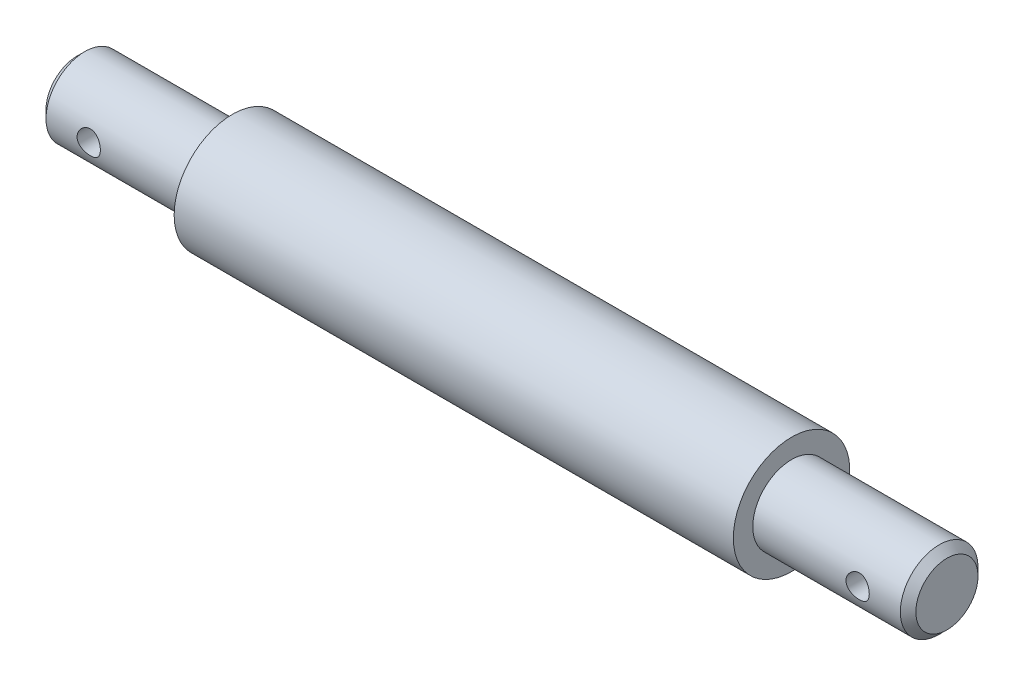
ISO-10303-21;
HEADER;
FILE_DESCRIPTION(('STEP AP214'),'2;1');
FILE_NAME('part.step','',(''),(''),'','','');
FILE_SCHEMA(('AUTOMOTIVE_DESIGN { 1 0 10303 214 1 1 1 1 }'));
ENDSEC;
DATA;
#1=APPLICATION_CONTEXT('core data for automotive mechanical design processes');
#2=APPLICATION_PROTOCOL_DEFINITION('international standard','automotive_design',2000,#1);
#3=PRODUCT_CONTEXT('',#1,'mechanical');
#4=PRODUCT('Part','Part','',(#3));
#5=PRODUCT_RELATED_PRODUCT_CATEGORY('part','',(#4));
#6=PRODUCT_DEFINITION_FORMATION('','',#4);
#7=PRODUCT_DEFINITION_CONTEXT('part definition',#1,'design');
#8=PRODUCT_DEFINITION('design','',#6,#7);
#9=PRODUCT_DEFINITION_SHAPE('','',#8);
#10=(LENGTH_UNIT() NAMED_UNIT(*) SI_UNIT(.MILLI.,.METRE.));
#11=(NAMED_UNIT(*) PLANE_ANGLE_UNIT() SI_UNIT($,.RADIAN.));
#12=(NAMED_UNIT(*) SI_UNIT($,.STERADIAN.) SOLID_ANGLE_UNIT());
#13=UNCERTAINTY_MEASURE_WITH_UNIT(LENGTH_MEASURE(1.E-05),#10,'distance_accuracy_value','');
#14=(GEOMETRIC_REPRESENTATION_CONTEXT(3) GLOBAL_UNCERTAINTY_ASSIGNED_CONTEXT((#13)) GLOBAL_UNIT_ASSIGNED_CONTEXT((#10,
#11,#12)) REPRESENTATION_CONTEXT('',''));
#15=CARTESIAN_POINT('',(0.,0.,0.));
#16=DIRECTION('',(0.,0.,1.));
#17=DIRECTION('',(1.,0.,0.));
#18=AXIS2_PLACEMENT_3D('',#15,#16,#17);
#19=CARTESIAN_POINT('',(-51.7168949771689,0.,0.));
#20=DIRECTION('',(1.,0.,0.));
#21=DIRECTION('',(0.,0.,-1.));
#22=AXIS2_PLACEMENT_3D('',#19,#20,#21);
#23=PLANE('',#22);
#24=CARTESIAN_POINT('',(-51.7168949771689,0.,0.));
#25=DIRECTION('',(-1.,0.,0.));
#26=DIRECTION('',(0.,0.,1.));
#27=AXIS2_PLACEMENT_3D('',#24,#25,#26);
#28=CIRCLE('',#27,4.);
#29=CARTESIAN_POINT('',(-51.7168949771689,0.,4.));
#30=VERTEX_POINT('',#29);
#31=EDGE_CURVE('E10',#30,#30,#28,.T.);
#32=ORIENTED_EDGE('',*,*,#31,.T.);
#33=EDGE_LOOP('',(#32));
#34=FACE_BOUND('',#33,.T.);
#35=ADVANCED_FACE('F34',(#34),#23,.F.);
#36=CARTESIAN_POINT('',(-50.7168949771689,0.,0.));
#37=DIRECTION('',(1.,0.,0.));
#38=DIRECTION('',(0.,0.,-1.));
#39=AXIS2_PLACEMENT_3D('',#36,#37,#38);
#40=CONICAL_SURFACE('',#39,5.,0.785398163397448);
#41=ORIENTED_EDGE('',*,*,#31,.F.);
#42=EDGE_LOOP('',(#41));
#43=FACE_BOUND('',#42,.T.);
#44=CARTESIAN_POINT('',(-50.7168949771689,0.,0.));
#45=DIRECTION('',(-1.,0.,0.));
#46=DIRECTION('',(0.,0.,1.));
#47=AXIS2_PLACEMENT_3D('',#44,#45,#46);
#48=CIRCLE('',#47,5.);
#49=CARTESIAN_POINT('',(-50.7168949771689,0.,5.));
#50=VERTEX_POINT('',#49);
#51=EDGE_CURVE('E45',#50,#50,#48,.T.);
#52=ORIENTED_EDGE('',*,*,#51,.T.);
#53=EDGE_LOOP('',(#52));
#54=FACE_BOUND('',#53,.T.);
#55=ADVANCED_FACE('F104',(#43,#54),#40,.T.);
#56=CARTESIAN_POINT('',(-59.9259259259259,0.,0.));
#57=DIRECTION('',(-1.,0.,0.));
#58=DIRECTION('',(0.,0.,1.));
#59=AXIS2_PLACEMENT_3D('',#56,#57,#58);
#60=CYLINDRICAL_SURFACE('',#59,5.);
#61=CARTESIAN_POINT('',(-43.7168949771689,0.,5.));
#62=CARTESIAN_POINT('',(-43.7168959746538,-0.0822886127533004,4.9999992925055));
#63=CARTESIAN_POINT('',(-43.7236888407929,-0.164587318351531,4.99794915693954));
#64=CARTESIAN_POINT('',(-43.750616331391,-0.326788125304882,4.98997105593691));
#65=CARTESIAN_POINT('',(-43.7707549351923,-0.406689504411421,4.98404193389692));
#66=CARTESIAN_POINT('',(-43.8236409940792,-0.561732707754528,4.96895552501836));
#67=CARTESIAN_POINT('',(-43.8563698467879,-0.636881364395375,4.95980300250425));
#68=CARTESIAN_POINT('',(-43.9334310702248,-0.780624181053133,4.93922109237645));
#69=CARTESIAN_POINT('',(-43.9777649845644,-0.849217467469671,4.92779140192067));
#70=CARTESIAN_POINT('',(-44.0781189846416,-0.979871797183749,4.90350737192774));
#71=CARTESIAN_POINT('',(-44.1344116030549,-1.04171807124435,4.89062383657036));
#72=CARTESIAN_POINT('',(-44.2565042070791,-1.15524920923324,4.86505834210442));
#73=CARTESIAN_POINT('',(-44.3223057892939,-1.20693236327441,4.85237641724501));
#74=CARTESIAN_POINT('',(-44.4633657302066,-1.29980037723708,4.82834113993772));
#75=CARTESIAN_POINT('',(-44.5388034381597,-1.34072309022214,4.81702406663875));
#76=CARTESIAN_POINT('',(-44.6958842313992,-1.40921394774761,4.79743620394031));
#77=CARTESIAN_POINT('',(-44.7775258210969,-1.43678529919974,4.78916468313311));
#78=CARTESIAN_POINT('',(-44.9422852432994,-1.47701633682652,4.77690870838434));
#79=CARTESIAN_POINT('',(-45.0252977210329,-1.49007196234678,4.77281069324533));
#80=CARTESIAN_POINT('',(-45.1924281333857,-1.50213730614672,4.76902789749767));
#81=CARTESIAN_POINT('',(-45.276545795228,-1.50115042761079,4.76934204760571));
#82=CARTESIAN_POINT('',(-45.4402788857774,-1.48546977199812,4.77424744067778));
#83=CARTESIAN_POINT('',(-45.5199472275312,-1.47127205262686,4.7786838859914));
#84=CARTESIAN_POINT('',(-45.6757147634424,-1.43037420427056,4.79108356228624));
#85=CARTESIAN_POINT('',(-45.7518136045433,-1.40367284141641,4.7990471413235));
#86=CARTESIAN_POINT('',(-45.8994953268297,-1.33816026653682,4.81772733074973));
#87=CARTESIAN_POINT('',(-45.9710020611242,-1.29918816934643,4.82848016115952));
#88=CARTESIAN_POINT('',(-46.1066269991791,-1.21035222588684,4.85150987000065));
#89=CARTESIAN_POINT('',(-46.1707434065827,-1.16048574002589,4.86378711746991));
#90=CARTESIAN_POINT('',(-46.292581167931,-1.04881290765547,4.88911011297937));
#91=CARTESIAN_POINT('',(-46.3499236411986,-0.986594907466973,4.90216654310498));
#92=CARTESIAN_POINT('',(-46.4534489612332,-0.853263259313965,4.92712244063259));
#93=CARTESIAN_POINT('',(-46.4996311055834,-0.782149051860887,4.9390218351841));
#94=CARTESIAN_POINT('',(-46.5797548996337,-0.632355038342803,4.9604316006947));
#95=CARTESIAN_POINT('',(-46.6136124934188,-0.55362774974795,4.96992543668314));
#96=CARTESIAN_POINT('',(-46.6674945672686,-0.391245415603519,4.98533521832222));
#97=CARTESIAN_POINT('',(-46.6875229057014,-0.307591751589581,4.99125216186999));
#98=CARTESIAN_POINT('',(-46.7125471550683,-0.140952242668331,4.99868364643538));
#99=CARTESIAN_POINT('',(-46.7180565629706,-0.0580500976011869,5.0003485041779));
#100=CARTESIAN_POINT('',(-46.7153258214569,0.107499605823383,4.9995292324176));
#101=CARTESIAN_POINT('',(-46.7070875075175,0.190147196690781,4.99704565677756));
#102=CARTESIAN_POINT('',(-46.6775103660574,0.350903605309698,4.98830696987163));
#103=CARTESIAN_POINT('',(-46.6564715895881,0.429072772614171,4.98213829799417));
#104=CARTESIAN_POINT('',(-46.6022517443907,0.580754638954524,4.96674347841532));
#105=CARTESIAN_POINT('',(-46.5690692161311,0.654266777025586,4.95751696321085));
#106=CARTESIAN_POINT('',(-46.4906418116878,0.796437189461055,4.93669654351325));
#107=CARTESIAN_POINT('',(-46.445135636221,0.864943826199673,4.92505280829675));
#108=CARTESIAN_POINT('',(-46.3436702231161,0.993523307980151,4.90073468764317));
#109=CARTESIAN_POINT('',(-46.2877083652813,1.05359403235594,4.8880600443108));
#110=CARTESIAN_POINT('',(-46.1645076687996,1.16585744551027,4.86253171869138));
#111=CARTESIAN_POINT('',(-46.0969331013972,1.21768481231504,4.84968825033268));
#112=CARTESIAN_POINT('',(-45.9537670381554,1.30928995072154,4.82576515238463));
#113=CARTESIAN_POINT('',(-45.8781757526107,1.34906803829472,4.81468547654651));
#114=CARTESIAN_POINT('',(-45.7213624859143,1.41517347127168,4.79567189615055));
#115=CARTESIAN_POINT('',(-45.6401687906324,1.4415634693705,4.78772337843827));
#116=CARTESIAN_POINT('',(-45.4742070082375,1.48021730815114,4.77591594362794));
#117=CARTESIAN_POINT('',(-45.3894401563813,1.49248598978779,4.772055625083));
#118=CARTESIAN_POINT('',(-45.2225334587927,1.50221984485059,4.76899972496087));
#119=CARTESIAN_POINT('',(-45.1404313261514,1.5002805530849,4.76961647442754));
#120=CARTESIAN_POINT('',(-44.9777808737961,1.48307505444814,4.77499401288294));
#121=CARTESIAN_POINT('',(-44.8972324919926,1.46780938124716,4.77975463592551));
#122=CARTESIAN_POINT('',(-44.7409495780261,1.42476888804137,4.79275763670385));
#123=CARTESIAN_POINT('',(-44.6651676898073,1.39715175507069,4.80095604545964));
#124=CARTESIAN_POINT('',(-44.5192525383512,1.3303150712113,4.81990278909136));
#125=CARTESIAN_POINT('',(-44.4491203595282,1.29109329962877,4.83065161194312));
#126=CARTESIAN_POINT('',(-44.3137318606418,1.20048763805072,4.85397676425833));
#127=CARTESIAN_POINT('',(-44.2487462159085,1.14871276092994,4.86660540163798));
#128=CARTESIAN_POINT('',(-44.1281924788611,1.03517434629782,4.89201320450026));
#129=CARTESIAN_POINT('',(-44.0726268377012,0.973408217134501,4.90479240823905));
#130=CARTESIAN_POINT('',(-43.9708715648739,0.839465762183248,4.92950936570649));
#131=CARTESIAN_POINT('',(-43.9250035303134,0.767037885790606,4.94141159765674));
#132=CARTESIAN_POINT('',(-43.8461598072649,0.615141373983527,4.96260680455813));
#133=CARTESIAN_POINT('',(-43.8131780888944,0.535676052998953,4.97190099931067));
#134=CARTESIAN_POINT('',(-43.7639997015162,0.38075771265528,4.98602174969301));
#135=CARTESIAN_POINT('',(-43.7463833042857,0.305786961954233,4.99122027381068));
#136=CARTESIAN_POINT('',(-43.7228314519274,0.153880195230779,4.99820944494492));
#137=CARTESIAN_POINT('',(-43.7168940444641,0.0769445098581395,5.0000006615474));
#138=CARTESIAN_POINT('',(-43.7168949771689,0.,5.));
#139=B_SPLINE_CURVE_WITH_KNOTS('',3,(#61,#62,#63,#64,#65,#66,#67,#68,#69,#70,#71,#72,#73,#74,
#75,#76,#77,#78,#79,#80,#81,#82,#83,#84,#85,#86,#87,#88,#89,#90,#91,#92,#93,#94,#95,#96,#97,#98,
#99,#100,#101,#102,#103,#104,#105,#106,#107,#108,#109,#110,#111,#112,#113,#114,#115,#116,#117,
#118,#119,#120,#121,#122,#123,#124,#125,#126,#127,#128,#129,#130,#131,#132,#133,#134,#135,#136,
#137,#138),.UNSPECIFIED.,.T.,.F.,(4,2,2,2,2,2,2,2,2,2,2,2,2,2,2,2,2,2,2,2,2,2,2,2,2,2,2,2,2,2,2,
2,2,2,2,2,2,2,4),(0.,0.246583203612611,0.493239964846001,0.739533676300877,0.985860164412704,
1.23855602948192,1.49129437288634,1.74971481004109,2.00807314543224,2.259196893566,
2.5102597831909,2.75226016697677,2.99428443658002,3.2396242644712,3.48502360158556,
3.74067104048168,3.99633456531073,4.2537104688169,4.51101453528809,4.75908809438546,
5.00712853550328,5.24956746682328,5.4920355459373,5.7401130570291,5.98825282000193,
6.2454040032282,6.50254844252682,6.75847814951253,7.01432009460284,7.25950155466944,
7.50467319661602,7.74680040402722,7.98897397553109,8.23996925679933,8.49102974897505,
8.74942996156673,9.00770911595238,9.23831691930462,9.46888616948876),.UNSPECIFIED.);
#140=CARTESIAN_POINT('',(-43.7168949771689,0.,5.));
#141=VERTEX_POINT('',#140);
#142=EDGE_CURVE('E61',#141,#141,#139,.T.);
#143=ORIENTED_EDGE('',*,*,#142,.T.);
#144=EDGE_LOOP('',(#143));
#145=FACE_BOUND('',#144,.T.);
#146=CARTESIAN_POINT('',(-43.7168949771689,0.,-5.));
#147=CARTESIAN_POINT('',(-43.7168959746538,0.0822886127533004,-4.9999992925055));
#148=CARTESIAN_POINT('',(-43.7236888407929,0.164587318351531,-4.99794915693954));
#149=CARTESIAN_POINT('',(-43.750616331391,0.326788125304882,-4.98997105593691));
#150=CARTESIAN_POINT('',(-43.7707549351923,0.406689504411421,-4.98404193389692));
#151=CARTESIAN_POINT('',(-43.8236409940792,0.561732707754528,-4.96895552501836));
#152=CARTESIAN_POINT('',(-43.8563698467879,0.636881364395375,-4.95980300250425));
#153=CARTESIAN_POINT('',(-43.9334310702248,0.780624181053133,-4.93922109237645));
#154=CARTESIAN_POINT('',(-43.9777649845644,0.849217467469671,-4.92779140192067));
#155=CARTESIAN_POINT('',(-44.0781189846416,0.979871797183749,-4.90350737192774));
#156=CARTESIAN_POINT('',(-44.1344116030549,1.04171807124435,-4.89062383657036));
#157=CARTESIAN_POINT('',(-44.2565042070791,1.15524920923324,-4.86505834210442));
#158=CARTESIAN_POINT('',(-44.3223057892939,1.20693236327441,-4.85237641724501));
#159=CARTESIAN_POINT('',(-44.4633657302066,1.29980037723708,-4.82834113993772));
#160=CARTESIAN_POINT('',(-44.5388034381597,1.34072309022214,-4.81702406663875));
#161=CARTESIAN_POINT('',(-44.6958842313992,1.40921394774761,-4.79743620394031));
#162=CARTESIAN_POINT('',(-44.7775258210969,1.43678529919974,-4.78916468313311));
#163=CARTESIAN_POINT('',(-44.9422852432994,1.47701633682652,-4.77690870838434));
#164=CARTESIAN_POINT('',(-45.0252977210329,1.49007196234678,-4.77281069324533));
#165=CARTESIAN_POINT('',(-45.1924281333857,1.50213730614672,-4.76902789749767));
#166=CARTESIAN_POINT('',(-45.276545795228,1.50115042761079,-4.76934204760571));
#167=CARTESIAN_POINT('',(-45.4402788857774,1.48546977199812,-4.77424744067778));
#168=CARTESIAN_POINT('',(-45.5199472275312,1.47127205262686,-4.7786838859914));
#169=CARTESIAN_POINT('',(-45.6757147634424,1.43037420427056,-4.79108356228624));
#170=CARTESIAN_POINT('',(-45.7518136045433,1.40367284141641,-4.7990471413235));
#171=CARTESIAN_POINT('',(-45.8994953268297,1.33816026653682,-4.81772733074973));
#172=CARTESIAN_POINT('',(-45.9710020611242,1.29918816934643,-4.82848016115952));
#173=CARTESIAN_POINT('',(-46.1066269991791,1.21035222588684,-4.85150987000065));
#174=CARTESIAN_POINT('',(-46.1707434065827,1.16048574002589,-4.86378711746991));
#175=CARTESIAN_POINT('',(-46.292581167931,1.04881290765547,-4.88911011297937));
#176=CARTESIAN_POINT('',(-46.3499236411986,0.986594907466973,-4.90216654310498));
#177=CARTESIAN_POINT('',(-46.4534489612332,0.853263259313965,-4.92712244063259));
#178=CARTESIAN_POINT('',(-46.4996311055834,0.782149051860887,-4.9390218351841));
#179=CARTESIAN_POINT('',(-46.5797548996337,0.632355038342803,-4.9604316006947));
#180=CARTESIAN_POINT('',(-46.6136124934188,0.55362774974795,-4.96992543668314));
#181=CARTESIAN_POINT('',(-46.6674945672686,0.391245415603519,-4.98533521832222));
#182=CARTESIAN_POINT('',(-46.6875229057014,0.307591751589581,-4.99125216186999));
#183=CARTESIAN_POINT('',(-46.7125471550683,0.140952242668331,-4.99868364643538));
#184=CARTESIAN_POINT('',(-46.7180565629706,0.0580500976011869,-5.0003485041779));
#185=CARTESIAN_POINT('',(-46.7153258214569,-0.107499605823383,-4.9995292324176));
#186=CARTESIAN_POINT('',(-46.7070875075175,-0.190147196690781,-4.99704565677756));
#187=CARTESIAN_POINT('',(-46.6775103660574,-0.350903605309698,-4.98830696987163));
#188=CARTESIAN_POINT('',(-46.6564715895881,-0.429072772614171,-4.98213829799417));
#189=CARTESIAN_POINT('',(-46.6022517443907,-0.580754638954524,-4.96674347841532));
#190=CARTESIAN_POINT('',(-46.5690692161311,-0.654266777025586,-4.95751696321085));
#191=CARTESIAN_POINT('',(-46.4906418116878,-0.796437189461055,-4.93669654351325));
#192=CARTESIAN_POINT('',(-46.445135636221,-0.864943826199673,-4.92505280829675));
#193=CARTESIAN_POINT('',(-46.3436702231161,-0.993523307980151,-4.90073468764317));
#194=CARTESIAN_POINT('',(-46.2877083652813,-1.05359403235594,-4.8880600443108));
#195=CARTESIAN_POINT('',(-46.1645076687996,-1.16585744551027,-4.86253171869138));
#196=CARTESIAN_POINT('',(-46.0969331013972,-1.21768481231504,-4.84968825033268));
#197=CARTESIAN_POINT('',(-45.9537670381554,-1.30928995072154,-4.82576515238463));
#198=CARTESIAN_POINT('',(-45.8781757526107,-1.34906803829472,-4.81468547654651));
#199=CARTESIAN_POINT('',(-45.7213624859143,-1.41517347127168,-4.79567189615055));
#200=CARTESIAN_POINT('',(-45.6401687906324,-1.4415634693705,-4.78772337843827));
#201=CARTESIAN_POINT('',(-45.4742070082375,-1.48021730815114,-4.77591594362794));
#202=CARTESIAN_POINT('',(-45.3894401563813,-1.49248598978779,-4.772055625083));
#203=CARTESIAN_POINT('',(-45.2225334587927,-1.50221984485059,-4.76899972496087));
#204=CARTESIAN_POINT('',(-45.1404313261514,-1.5002805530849,-4.76961647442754));
#205=CARTESIAN_POINT('',(-44.9777808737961,-1.48307505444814,-4.77499401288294));
#206=CARTESIAN_POINT('',(-44.8972324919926,-1.46780938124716,-4.77975463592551));
#207=CARTESIAN_POINT('',(-44.7409495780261,-1.42476888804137,-4.79275763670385));
#208=CARTESIAN_POINT('',(-44.6651676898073,-1.39715175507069,-4.80095604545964));
#209=CARTESIAN_POINT('',(-44.5192525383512,-1.3303150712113,-4.81990278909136));
#210=CARTESIAN_POINT('',(-44.4491203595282,-1.29109329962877,-4.83065161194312));
#211=CARTESIAN_POINT('',(-44.3137318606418,-1.20048763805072,-4.85397676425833));
#212=CARTESIAN_POINT('',(-44.2487462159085,-1.14871276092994,-4.86660540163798));
#213=CARTESIAN_POINT('',(-44.1281924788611,-1.03517434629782,-4.89201320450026));
#214=CARTESIAN_POINT('',(-44.0726268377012,-0.973408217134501,-4.90479240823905));
#215=CARTESIAN_POINT('',(-43.9708715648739,-0.839465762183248,-4.92950936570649));
#216=CARTESIAN_POINT('',(-43.9250035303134,-0.767037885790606,-4.94141159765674));
#217=CARTESIAN_POINT('',(-43.8461598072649,-0.615141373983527,-4.96260680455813));
#218=CARTESIAN_POINT('',(-43.8131780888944,-0.535676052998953,-4.97190099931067));
#219=CARTESIAN_POINT('',(-43.7639997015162,-0.38075771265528,-4.98602174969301));
#220=CARTESIAN_POINT('',(-43.7463833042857,-0.305786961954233,-4.99122027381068));
#221=CARTESIAN_POINT('',(-43.7228314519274,-0.153880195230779,-4.99820944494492));
#222=CARTESIAN_POINT('',(-43.7168940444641,-0.0769445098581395,-5.0000006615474));
#223=CARTESIAN_POINT('',(-43.7168949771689,0.,-5.));
#224=B_SPLINE_CURVE_WITH_KNOTS('',3,(#146,#147,#148,#149,#150,#151,#152,#153,#154,#155,#156,
#157,#158,#159,#160,#161,#162,#163,#164,#165,#166,#167,#168,#169,#170,#171,#172,#173,#174,#175,
#176,#177,#178,#179,#180,#181,#182,#183,#184,#185,#186,#187,#188,#189,#190,#191,#192,#193,#194,
#195,#196,#197,#198,#199,#200,#201,#202,#203,#204,#205,#206,#207,#208,#209,#210,#211,#212,#213,
#214,#215,#216,#217,#218,#219,#220,#221,#222,#223),.UNSPECIFIED.,.T.,.F.,(4,2,2,2,2,2,2,2,2,2,2,
2,2,2,2,2,2,2,2,2,2,2,2,2,2,2,2,2,2,2,2,2,2,2,2,2,2,2,4),(0.,0.246583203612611,
0.493239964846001,0.739533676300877,0.985860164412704,1.23855602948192,1.49129437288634,
1.74971481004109,2.00807314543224,2.259196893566,2.5102597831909,2.75226016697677,
2.99428443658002,3.2396242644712,3.48502360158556,3.74067104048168,3.99633456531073,
4.2537104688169,4.51101453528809,4.75908809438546,5.00712853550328,5.24956746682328,
5.4920355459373,5.7401130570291,5.98825282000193,6.2454040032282,6.50254844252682,
6.75847814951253,7.01432009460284,7.25950155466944,7.50467319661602,7.74680040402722,
7.98897397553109,8.23996925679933,8.49102974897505,8.74942996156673,9.00770911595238,
9.23831691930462,9.46888616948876),.UNSPECIFIED.);
#225=CARTESIAN_POINT('',(-43.7168949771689,0.,-5.));
#226=VERTEX_POINT('',#225);
#227=EDGE_CURVE('E54',#226,#226,#224,.T.);
#228=ORIENTED_EDGE('',*,*,#227,.T.);
#229=EDGE_LOOP('',(#228));
#230=FACE_BOUND('',#229,.T.);
#231=ORIENTED_EDGE('',*,*,#51,.F.);
#232=EDGE_LOOP('',(#231));
#233=FACE_BOUND('',#232,.T.);
#234=CARTESIAN_POINT('',(-31.7168949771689,0.,0.));
#235=DIRECTION('',(-1.,0.,0.));
#236=DIRECTION('',(0.,0.,1.));
#237=AXIS2_PLACEMENT_3D('',#234,#235,#236);
#238=CIRCLE('',#237,5.);
#239=CARTESIAN_POINT('',(-31.7168949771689,0.,5.));
#240=VERTEX_POINT('',#239);
#241=EDGE_CURVE('E50',#240,#240,#238,.T.);
#242=ORIENTED_EDGE('',*,*,#241,.T.);
#243=EDGE_LOOP('',(#242));
#244=FACE_BOUND('',#243,.T.);
#245=ADVANCED_FACE('F64',(#145,#230,#233,#244),#60,.T.);
#246=CARTESIAN_POINT('',(-31.7168949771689,5.,0.));
#247=DIRECTION('',(1.,0.,0.));
#248=DIRECTION('',(0.,0.,-1.));
#249=AXIS2_PLACEMENT_3D('',#246,#247,#248);
#250=PLANE('',#249);
#251=ORIENTED_EDGE('',*,*,#241,.F.);
#252=EDGE_LOOP('',(#251));
#253=FACE_BOUND('',#252,.T.);
#254=CARTESIAN_POINT('',(-31.7168949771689,0.,0.));
#255=DIRECTION('',(-1.,0.,0.));
#256=DIRECTION('',(0.,0.,1.));
#257=AXIS2_PLACEMENT_3D('',#254,#255,#256);
#258=CIRCLE('',#257,7.5);
#259=CARTESIAN_POINT('',(-31.7168949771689,0.,7.5));
#260=VERTEX_POINT('',#259);
#261=EDGE_CURVE('E121',#260,#260,#258,.T.);
#262=ORIENTED_EDGE('',*,*,#261,.T.);
#263=EDGE_LOOP('',(#262));
#264=FACE_BOUND('',#263,.T.);
#265=ADVANCED_FACE('F112',(#253,#264),#250,.F.);
#266=CARTESIAN_POINT('',(-59.9259259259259,0.,0.));
#267=DIRECTION('',(-1.,0.,0.));
#268=DIRECTION('',(0.,0.,1.));
#269=AXIS2_PLACEMENT_3D('',#266,#267,#268);
#270=CYLINDRICAL_SURFACE('',#269,7.5);
#271=ORIENTED_EDGE('',*,*,#261,.F.);
#272=EDGE_LOOP('',(#271));
#273=FACE_BOUND('',#272,.T.);
#274=CARTESIAN_POINT('',(40.2831050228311,0.,0.));
#275=DIRECTION('',(-1.,0.,0.));
#276=DIRECTION('',(0.,0.,1.));
#277=AXIS2_PLACEMENT_3D('',#274,#275,#276);
#278=CIRCLE('',#277,7.5);
#279=CARTESIAN_POINT('',(40.2831050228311,0.,7.5));
#280=VERTEX_POINT('',#279);
#281=EDGE_CURVE('E123',#280,#280,#278,.T.);
#282=ORIENTED_EDGE('',*,*,#281,.T.);
#283=EDGE_LOOP('',(#282));
#284=FACE_BOUND('',#283,.T.);
#285=ADVANCED_FACE('F149',(#273,#284),#270,.T.);
#286=CARTESIAN_POINT('',(40.2831050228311,7.5,0.));
#287=DIRECTION('',(-1.,0.,0.));
#288=DIRECTION('',(0.,0.,1.));
#289=AXIS2_PLACEMENT_3D('',#286,#287,#288);
#290=PLANE('',#289);
#291=ORIENTED_EDGE('',*,*,#281,.F.);
#292=EDGE_LOOP('',(#291));
#293=FACE_BOUND('',#292,.T.);
#294=CARTESIAN_POINT('',(40.2831050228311,0.,0.));
#295=DIRECTION('',(-1.,0.,0.));
#296=DIRECTION('',(0.,0.,1.));
#297=AXIS2_PLACEMENT_3D('',#294,#295,#296);
#298=CIRCLE('',#297,5.);
#299=CARTESIAN_POINT('',(40.2831050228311,0.,5.));
#300=VERTEX_POINT('',#299);
#301=EDGE_CURVE('E128',#300,#300,#298,.T.);
#302=ORIENTED_EDGE('',*,*,#301,.T.);
#303=EDGE_LOOP('',(#302));
#304=FACE_BOUND('',#303,.T.);
#305=ADVANCED_FACE('F86',(#293,#304),#290,.F.);
#306=CARTESIAN_POINT('',(-59.9259259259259,0.,0.));
#307=DIRECTION('',(-1.,0.,0.));
#308=DIRECTION('',(0.,0.,1.));
#309=AXIS2_PLACEMENT_3D('',#306,#307,#308);
#310=CYLINDRICAL_SURFACE('',#309,5.);
#311=CARTESIAN_POINT('',(55.2831050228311,0.,5.));
#312=CARTESIAN_POINT('',(55.2831040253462,-0.0822886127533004,4.9999992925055));
#313=CARTESIAN_POINT('',(55.2763111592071,-0.164587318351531,4.99794915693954));
#314=CARTESIAN_POINT('',(55.249383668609,-0.326788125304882,4.98997105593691));
#315=CARTESIAN_POINT('',(55.2292450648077,-0.406689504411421,4.98404193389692));
#316=CARTESIAN_POINT('',(55.1763590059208,-0.561732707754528,4.96895552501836));
#317=CARTESIAN_POINT('',(55.1436301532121,-0.636881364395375,4.95980300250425));
#318=CARTESIAN_POINT('',(55.0665689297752,-0.780624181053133,4.93922109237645));
#319=CARTESIAN_POINT('',(55.0222350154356,-0.849217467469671,4.92779140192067));
#320=CARTESIAN_POINT('',(54.9218810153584,-0.979871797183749,4.90350737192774));
#321=CARTESIAN_POINT('',(54.8655883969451,-1.04171807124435,4.89062383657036));
#322=CARTESIAN_POINT('',(54.7434957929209,-1.15524920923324,4.86505834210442));
#323=CARTESIAN_POINT('',(54.6776942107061,-1.20693236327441,4.85237641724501));
#324=CARTESIAN_POINT('',(54.5366342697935,-1.29980037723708,4.82834113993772));
#325=CARTESIAN_POINT('',(54.4611965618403,-1.34072309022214,4.81702406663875));
#326=CARTESIAN_POINT('',(54.3041157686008,-1.40921394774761,4.79743620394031));
#327=CARTESIAN_POINT('',(54.2224741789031,-1.43678529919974,4.78916468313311));
#328=CARTESIAN_POINT('',(54.0577147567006,-1.47701633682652,4.77690870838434));
#329=CARTESIAN_POINT('',(53.9747022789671,-1.49007196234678,4.77281069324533));
#330=CARTESIAN_POINT('',(53.8075718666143,-1.50213730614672,4.76902789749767));
#331=CARTESIAN_POINT('',(53.723454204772,-1.50115042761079,4.76934204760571));
#332=CARTESIAN_POINT('',(53.5597211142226,-1.48546977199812,4.77424744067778));
#333=CARTESIAN_POINT('',(53.4800527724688,-1.47127205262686,4.7786838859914));
#334=CARTESIAN_POINT('',(53.3242852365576,-1.43037420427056,4.79108356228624));
#335=CARTESIAN_POINT('',(53.2481863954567,-1.40367284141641,4.7990471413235));
#336=CARTESIAN_POINT('',(53.1005046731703,-1.33816026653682,4.81772733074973));
#337=CARTESIAN_POINT('',(53.0289979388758,-1.29918816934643,4.82848016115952));
#338=CARTESIAN_POINT('',(52.8933730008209,-1.21035222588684,4.85150987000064));
#339=CARTESIAN_POINT('',(52.8292565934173,-1.16048574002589,4.86378711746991));
#340=CARTESIAN_POINT('',(52.707418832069,-1.04881290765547,4.88911011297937));
#341=CARTESIAN_POINT('',(52.6500763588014,-0.986594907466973,4.90216654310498));
#342=CARTESIAN_POINT('',(52.5465510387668,-0.853263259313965,4.92712244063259));
#343=CARTESIAN_POINT('',(52.5003688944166,-0.782149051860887,4.9390218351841));
#344=CARTESIAN_POINT('',(52.4202451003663,-0.632355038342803,4.9604316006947));
#345=CARTESIAN_POINT('',(52.3863875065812,-0.55362774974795,4.96992543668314));
#346=CARTESIAN_POINT('',(52.3325054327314,-0.391245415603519,4.98533521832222));
#347=CARTESIAN_POINT('',(52.3124770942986,-0.307591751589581,4.99125216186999));
#348=CARTESIAN_POINT('',(52.2874528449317,-0.140952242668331,4.99868364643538));
#349=CARTESIAN_POINT('',(52.2819434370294,-0.0580500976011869,5.0003485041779));
#350=CARTESIAN_POINT('',(52.2846741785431,0.107499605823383,4.9995292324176));
#351=CARTESIAN_POINT('',(52.2929124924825,0.190147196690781,4.99704565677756));
#352=CARTESIAN_POINT('',(52.3224896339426,0.350903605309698,4.98830696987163));
#353=CARTESIAN_POINT('',(52.3435284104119,0.429072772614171,4.98213829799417));
#354=CARTESIAN_POINT('',(52.3977482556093,0.580754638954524,4.96674347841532));
#355=CARTESIAN_POINT('',(52.4309307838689,0.654266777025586,4.95751696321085));
#356=CARTESIAN_POINT('',(52.5093581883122,0.796437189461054,4.93669654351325));
#357=CARTESIAN_POINT('',(52.554864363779,0.86494382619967,4.92505280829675));
#358=CARTESIAN_POINT('',(52.6563297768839,0.993523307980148,4.90073468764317));
#359=CARTESIAN_POINT('',(52.7122916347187,1.05359403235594,4.8880600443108));
#360=CARTESIAN_POINT('',(52.8354923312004,1.16585744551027,4.86253171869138));
#361=CARTESIAN_POINT('',(52.9030668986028,1.21768481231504,4.84968825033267));
#362=CARTESIAN_POINT('',(53.0462329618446,1.30928995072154,4.82576515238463));
#363=CARTESIAN_POINT('',(53.1218242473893,1.34906803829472,4.81468547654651));
#364=CARTESIAN_POINT('',(53.2786375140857,1.41517347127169,4.79567189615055));
#365=CARTESIAN_POINT('',(53.3598312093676,1.4415634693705,4.78772337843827));
#366=CARTESIAN_POINT('',(53.5257929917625,1.48021730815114,4.77591594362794));
#367=CARTESIAN_POINT('',(53.6105598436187,1.49248598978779,4.772055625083));
#368=CARTESIAN_POINT('',(53.7774665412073,1.50221984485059,4.76899972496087));
#369=CARTESIAN_POINT('',(53.8595686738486,1.5002805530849,4.76961647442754));
#370=CARTESIAN_POINT('',(54.0222191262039,1.48307505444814,4.77499401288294));
#371=CARTESIAN_POINT('',(54.1027675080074,1.46780938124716,4.77975463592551));
#372=CARTESIAN_POINT('',(54.2590504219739,1.42476888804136,4.79275763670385));
#373=CARTESIAN_POINT('',(54.3348323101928,1.39715175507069,4.80095604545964));
#374=CARTESIAN_POINT('',(54.4807474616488,1.3303150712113,4.81990278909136));
#375=CARTESIAN_POINT('',(54.5508796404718,1.29109329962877,4.83065161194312));
#376=CARTESIAN_POINT('',(54.6862681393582,1.20048763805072,4.85397676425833));
#377=CARTESIAN_POINT('',(54.7512537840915,1.14871276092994,4.86660540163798));
#378=CARTESIAN_POINT('',(54.8718075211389,1.03517434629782,4.89201320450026));
#379=CARTESIAN_POINT('',(54.9273731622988,0.973408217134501,4.90479240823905));
#380=CARTESIAN_POINT('',(55.0291284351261,0.839465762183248,4.92950936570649));
#381=CARTESIAN_POINT('',(55.0749964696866,0.767037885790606,4.94141159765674));
#382=CARTESIAN_POINT('',(55.1538401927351,0.615141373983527,4.96260680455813));
#383=CARTESIAN_POINT('',(55.1868219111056,0.535676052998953,4.97190099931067));
#384=CARTESIAN_POINT('',(55.2360002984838,0.38075771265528,4.98602174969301));
#385=CARTESIAN_POINT('',(55.2536166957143,0.305786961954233,4.99122027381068));
#386=CARTESIAN_POINT('',(55.2771685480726,0.153880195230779,4.99820944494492));
#387=CARTESIAN_POINT('',(55.2831059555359,0.0769445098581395,5.0000006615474));
#388=CARTESIAN_POINT('',(55.2831050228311,0.,5.));
#389=B_SPLINE_CURVE_WITH_KNOTS('',3,(#311,#312,#313,#314,#315,#316,#317,#318,#319,#320,#321,
#322,#323,#324,#325,#326,#327,#328,#329,#330,#331,#332,#333,#334,#335,#336,#337,#338,#339,#340,
#341,#342,#343,#344,#345,#346,#347,#348,#349,#350,#351,#352,#353,#354,#355,#356,#357,#358,#359,
#360,#361,#362,#363,#364,#365,#366,#367,#368,#369,#370,#371,#372,#373,#374,#375,#376,#377,#378,
#379,#380,#381,#382,#383,#384,#385,#386,#387,#388),.UNSPECIFIED.,.T.,.F.,(4,2,2,2,2,2,2,2,2,2,2,
2,2,2,2,2,2,2,2,2,2,2,2,2,2,2,2,2,2,2,2,2,2,2,2,2,2,2,4),(0.,0.246583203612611,
0.493239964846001,0.739533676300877,0.985860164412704,1.23855602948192,1.49129437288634,
1.74971481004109,2.00807314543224,2.259196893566,2.5102597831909,2.75226016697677,
2.99428443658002,3.2396242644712,3.48502360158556,3.74067104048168,3.99633456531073,
4.2537104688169,4.51101453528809,4.75908809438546,5.00712853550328,5.24956746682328,
5.4920355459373,5.7401130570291,5.98825282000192,6.24540400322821,6.50254844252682,
6.75847814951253,7.01432009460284,7.25950155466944,7.50467319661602,7.74680040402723,
7.98897397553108,8.23996925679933,8.49102974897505,8.74942996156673,9.00770911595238,
9.23831691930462,9.46888616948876),.UNSPECIFIED.);
#390=CARTESIAN_POINT('',(55.2831050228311,0.,5.));
#391=VERTEX_POINT('',#390);
#392=EDGE_CURVE('E37',#391,#391,#389,.T.);
#393=ORIENTED_EDGE('',*,*,#392,.T.);
#394=EDGE_LOOP('',(#393));
#395=FACE_BOUND('',#394,.T.);
#396=CARTESIAN_POINT('',(55.2831050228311,0.,-5.));
#397=CARTESIAN_POINT('',(55.2831040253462,0.0822886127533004,-4.9999992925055));
#398=CARTESIAN_POINT('',(55.2763111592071,0.164587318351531,-4.99794915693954));
#399=CARTESIAN_POINT('',(55.249383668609,0.326788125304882,-4.98997105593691));
#400=CARTESIAN_POINT('',(55.2292450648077,0.406689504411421,-4.98404193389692));
#401=CARTESIAN_POINT('',(55.1763590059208,0.561732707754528,-4.96895552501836));
#402=CARTESIAN_POINT('',(55.1436301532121,0.636881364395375,-4.95980300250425));
#403=CARTESIAN_POINT('',(55.0665689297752,0.780624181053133,-4.93922109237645));
#404=CARTESIAN_POINT('',(55.0222350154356,0.849217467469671,-4.92779140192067));
#405=CARTESIAN_POINT('',(54.9218810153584,0.979871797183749,-4.90350737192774));
#406=CARTESIAN_POINT('',(54.8655883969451,1.04171807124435,-4.89062383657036));
#407=CARTESIAN_POINT('',(54.7434957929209,1.15524920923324,-4.86505834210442));
#408=CARTESIAN_POINT('',(54.6776942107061,1.20693236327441,-4.85237641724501));
#409=CARTESIAN_POINT('',(54.5366342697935,1.29980037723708,-4.82834113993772));
#410=CARTESIAN_POINT('',(54.4611965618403,1.34072309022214,-4.81702406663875));
#411=CARTESIAN_POINT('',(54.3041157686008,1.40921394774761,-4.79743620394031));
#412=CARTESIAN_POINT('',(54.2224741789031,1.43678529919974,-4.78916468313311));
#413=CARTESIAN_POINT('',(54.0577147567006,1.47701633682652,-4.77690870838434));
#414=CARTESIAN_POINT('',(53.9747022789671,1.49007196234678,-4.77281069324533));
#415=CARTESIAN_POINT('',(53.8075718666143,1.50213730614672,-4.76902789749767));
#416=CARTESIAN_POINT('',(53.723454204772,1.50115042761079,-4.76934204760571));
#417=CARTESIAN_POINT('',(53.5597211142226,1.48546977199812,-4.77424744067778));
#418=CARTESIAN_POINT('',(53.4800527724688,1.47127205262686,-4.7786838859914));
#419=CARTESIAN_POINT('',(53.3242852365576,1.43037420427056,-4.79108356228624));
#420=CARTESIAN_POINT('',(53.2481863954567,1.40367284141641,-4.7990471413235));
#421=CARTESIAN_POINT('',(53.1005046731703,1.33816026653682,-4.81772733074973));
#422=CARTESIAN_POINT('',(53.0289979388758,1.29918816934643,-4.82848016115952));
#423=CARTESIAN_POINT('',(52.8933730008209,1.21035222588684,-4.85150987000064));
#424=CARTESIAN_POINT('',(52.8292565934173,1.16048574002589,-4.86378711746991));
#425=CARTESIAN_POINT('',(52.707418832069,1.04881290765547,-4.88911011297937));
#426=CARTESIAN_POINT('',(52.6500763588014,0.986594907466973,-4.90216654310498));
#427=CARTESIAN_POINT('',(52.5465510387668,0.853263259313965,-4.92712244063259));
#428=CARTESIAN_POINT('',(52.5003688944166,0.782149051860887,-4.9390218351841));
#429=CARTESIAN_POINT('',(52.4202451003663,0.632355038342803,-4.9604316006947));
#430=CARTESIAN_POINT('',(52.3863875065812,0.55362774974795,-4.96992543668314));
#431=CARTESIAN_POINT('',(52.3325054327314,0.391245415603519,-4.98533521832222));
#432=CARTESIAN_POINT('',(52.3124770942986,0.307591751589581,-4.99125216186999));
#433=CARTESIAN_POINT('',(52.2874528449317,0.140952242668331,-4.99868364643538));
#434=CARTESIAN_POINT('',(52.2819434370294,0.0580500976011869,-5.0003485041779));
#435=CARTESIAN_POINT('',(52.2846741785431,-0.107499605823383,-4.9995292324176));
#436=CARTESIAN_POINT('',(52.2929124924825,-0.190147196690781,-4.99704565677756));
#437=CARTESIAN_POINT('',(52.3224896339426,-0.350903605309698,-4.98830696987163));
#438=CARTESIAN_POINT('',(52.3435284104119,-0.429072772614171,-4.98213829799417));
#439=CARTESIAN_POINT('',(52.3977482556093,-0.580754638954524,-4.96674347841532));
#440=CARTESIAN_POINT('',(52.4309307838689,-0.654266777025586,-4.95751696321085));
#441=CARTESIAN_POINT('',(52.5093581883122,-0.796437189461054,-4.93669654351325));
#442=CARTESIAN_POINT('',(52.554864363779,-0.86494382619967,-4.92505280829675));
#443=CARTESIAN_POINT('',(52.6563297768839,-0.993523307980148,-4.90073468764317));
#444=CARTESIAN_POINT('',(52.7122916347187,-1.05359403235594,-4.8880600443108));
#445=CARTESIAN_POINT('',(52.8354923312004,-1.16585744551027,-4.86253171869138));
#446=CARTESIAN_POINT('',(52.9030668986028,-1.21768481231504,-4.84968825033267));
#447=CARTESIAN_POINT('',(53.0462329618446,-1.30928995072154,-4.82576515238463));
#448=CARTESIAN_POINT('',(53.1218242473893,-1.34906803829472,-4.81468547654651));
#449=CARTESIAN_POINT('',(53.2786375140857,-1.41517347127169,-4.79567189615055));
#450=CARTESIAN_POINT('',(53.3598312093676,-1.4415634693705,-4.78772337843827));
#451=CARTESIAN_POINT('',(53.5257929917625,-1.48021730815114,-4.77591594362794));
#452=CARTESIAN_POINT('',(53.6105598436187,-1.49248598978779,-4.772055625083));
#453=CARTESIAN_POINT('',(53.7774665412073,-1.50221984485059,-4.76899972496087));
#454=CARTESIAN_POINT('',(53.8595686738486,-1.5002805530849,-4.76961647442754));
#455=CARTESIAN_POINT('',(54.0222191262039,-1.48307505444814,-4.77499401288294));
#456=CARTESIAN_POINT('',(54.1027675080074,-1.46780938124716,-4.77975463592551));
#457=CARTESIAN_POINT('',(54.2590504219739,-1.42476888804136,-4.79275763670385));
#458=CARTESIAN_POINT('',(54.3348323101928,-1.39715175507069,-4.80095604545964));
#459=CARTESIAN_POINT('',(54.4807474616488,-1.3303150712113,-4.81990278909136));
#460=CARTESIAN_POINT('',(54.5508796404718,-1.29109329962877,-4.83065161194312));
#461=CARTESIAN_POINT('',(54.6862681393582,-1.20048763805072,-4.85397676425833));
#462=CARTESIAN_POINT('',(54.7512537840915,-1.14871276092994,-4.86660540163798));
#463=CARTESIAN_POINT('',(54.8718075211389,-1.03517434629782,-4.89201320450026));
#464=CARTESIAN_POINT('',(54.9273731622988,-0.973408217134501,-4.90479240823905));
#465=CARTESIAN_POINT('',(55.0291284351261,-0.839465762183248,-4.92950936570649));
#466=CARTESIAN_POINT('',(55.0749964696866,-0.767037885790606,-4.94141159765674));
#467=CARTESIAN_POINT('',(55.1538401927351,-0.615141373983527,-4.96260680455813));
#468=CARTESIAN_POINT('',(55.1868219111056,-0.535676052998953,-4.97190099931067));
#469=CARTESIAN_POINT('',(55.2360002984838,-0.38075771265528,-4.98602174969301));
#470=CARTESIAN_POINT('',(55.2536166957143,-0.305786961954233,-4.99122027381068));
#471=CARTESIAN_POINT('',(55.2771685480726,-0.153880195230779,-4.99820944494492));
#472=CARTESIAN_POINT('',(55.2831059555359,-0.0769445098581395,-5.0000006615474));
#473=CARTESIAN_POINT('',(55.2831050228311,0.,-5.));
#474=B_SPLINE_CURVE_WITH_KNOTS('',3,(#396,#397,#398,#399,#400,#401,#402,#403,#404,#405,#406,
#407,#408,#409,#410,#411,#412,#413,#414,#415,#416,#417,#418,#419,#420,#421,#422,#423,#424,#425,
#426,#427,#428,#429,#430,#431,#432,#433,#434,#435,#436,#437,#438,#439,#440,#441,#442,#443,#444,
#445,#446,#447,#448,#449,#450,#451,#452,#453,#454,#455,#456,#457,#458,#459,#460,#461,#462,#463,
#464,#465,#466,#467,#468,#469,#470,#471,#472,#473),.UNSPECIFIED.,.T.,.F.,(4,2,2,2,2,2,2,2,2,2,2,
2,2,2,2,2,2,2,2,2,2,2,2,2,2,2,2,2,2,2,2,2,2,2,2,2,2,2,4),(0.,0.246583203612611,
0.493239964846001,0.739533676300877,0.985860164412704,1.23855602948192,1.49129437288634,
1.74971481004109,2.00807314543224,2.259196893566,2.5102597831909,2.75226016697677,
2.99428443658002,3.2396242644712,3.48502360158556,3.74067104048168,3.99633456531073,
4.2537104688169,4.51101453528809,4.75908809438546,5.00712853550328,5.24956746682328,
5.4920355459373,5.7401130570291,5.98825282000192,6.24540400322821,6.50254844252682,
6.75847814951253,7.01432009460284,7.25950155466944,7.50467319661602,7.74680040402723,
7.98897397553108,8.23996925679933,8.49102974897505,8.74942996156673,9.00770911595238,
9.23831691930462,9.46888616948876),.UNSPECIFIED.);
#475=CARTESIAN_POINT('',(55.2831050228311,0.,-5.));
#476=VERTEX_POINT('',#475);
#477=EDGE_CURVE('E90',#476,#476,#474,.T.);
#478=ORIENTED_EDGE('',*,*,#477,.T.);
#479=EDGE_LOOP('',(#478));
#480=FACE_BOUND('',#479,.T.);
#481=ORIENTED_EDGE('',*,*,#301,.F.);
#482=EDGE_LOOP('',(#481));
#483=FACE_BOUND('',#482,.T.);
#484=CARTESIAN_POINT('',(59.2831050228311,0.,0.));
#485=DIRECTION('',(-1.,0.,0.));
#486=DIRECTION('',(0.,0.,1.));
#487=AXIS2_PLACEMENT_3D('',#484,#485,#486);
#488=CIRCLE('',#487,5.);
#489=CARTESIAN_POINT('',(59.2831050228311,0.,5.));
#490=VERTEX_POINT('',#489);
#491=EDGE_CURVE('E131',#490,#490,#488,.T.);
#492=ORIENTED_EDGE('',*,*,#491,.T.);
#493=EDGE_LOOP('',(#492));
#494=FACE_BOUND('',#493,.T.);
#495=ADVANCED_FACE('F81',(#395,#480,#483,#494),#310,.T.);
#496=CARTESIAN_POINT('',(60.2831050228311,0.,0.));
#497=DIRECTION('',(-1.,0.,0.));
#498=DIRECTION('',(0.,0.,1.));
#499=AXIS2_PLACEMENT_3D('',#496,#497,#498);
#500=CONICAL_SURFACE('',#499,4.,0.785398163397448);
#501=ORIENTED_EDGE('',*,*,#491,.F.);
#502=EDGE_LOOP('',(#501));
#503=FACE_BOUND('',#502,.T.);
#504=CARTESIAN_POINT('',(60.2831050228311,0.,0.));
#505=DIRECTION('',(-1.,0.,0.));
#506=DIRECTION('',(0.,0.,1.));
#507=AXIS2_PLACEMENT_3D('',#504,#505,#506);
#508=CIRCLE('',#507,4.);
#509=CARTESIAN_POINT('',(60.2831050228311,0.,4.));
#510=VERTEX_POINT('',#509);
#511=EDGE_CURVE('E134',#510,#510,#508,.T.);
#512=ORIENTED_EDGE('',*,*,#511,.T.);
#513=EDGE_LOOP('',(#512));
#514=FACE_BOUND('',#513,.T.);
#515=ADVANCED_FACE('F78',(#503,#514),#500,.T.);
#516=CARTESIAN_POINT('',(60.2831050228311,4.,0.));
#517=DIRECTION('',(-1.,0.,0.));
#518=DIRECTION('',(0.,0.,1.));
#519=AXIS2_PLACEMENT_3D('',#516,#517,#518);
#520=PLANE('',#519);
#521=ORIENTED_EDGE('',*,*,#511,.F.);
#522=EDGE_LOOP('',(#521));
#523=FACE_BOUND('',#522,.T.);
#524=ADVANCED_FACE('F72',(#523),#520,.F.);
#525=CARTESIAN_POINT('',(-45.2168949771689,0.,-20.));
#526=DIRECTION('',(0.,0.,1.));
#527=DIRECTION('',(1.,0.,0.));
#528=AXIS2_PLACEMENT_3D('',#525,#526,#527);
#529=CYLINDRICAL_SURFACE('',#528,1.5);
#530=ORIENTED_EDGE('',*,*,#227,.F.);
#531=EDGE_LOOP('',(#530));
#532=FACE_BOUND('',#531,.T.);
#533=ORIENTED_EDGE('',*,*,#142,.F.);
#534=EDGE_LOOP('',(#533));
#535=FACE_BOUND('',#534,.T.);
#536=ADVANCED_FACE('F67',(#532,#535),#529,.F.);
#537=CARTESIAN_POINT('',(53.7831050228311,0.,-20.));
#538=DIRECTION('',(0.,0.,1.));
#539=DIRECTION('',(1.,0.,0.));
#540=AXIS2_PLACEMENT_3D('',#537,#538,#539);
#541=CYLINDRICAL_SURFACE('',#540,1.5);
#542=ORIENTED_EDGE('',*,*,#477,.F.);
#543=EDGE_LOOP('',(#542));
#544=FACE_BOUND('',#543,.T.);
#545=ORIENTED_EDGE('',*,*,#392,.F.);
#546=EDGE_LOOP('',(#545));
#547=FACE_BOUND('',#546,.T.);
#548=ADVANCED_FACE('F71',(#544,#547),#541,.F.);
#549=CLOSED_SHELL('',(#35,#55,#245,#265,#285,#305,#495,#515,#524,#536,#548));
#550=MANIFOLD_SOLID_BREP('B2',#549);
#551=ADVANCED_BREP_SHAPE_REPRESENTATION('',(#18,#550),#14);
#552=SHAPE_DEFINITION_REPRESENTATION(#9,#551);
ENDSEC;
END-ISO-10303-21;
